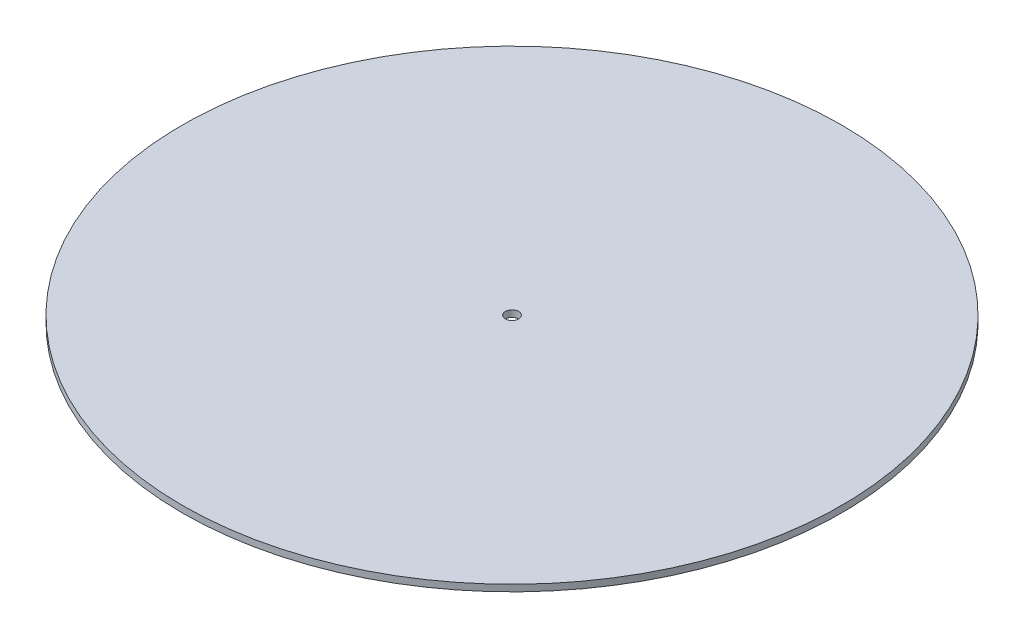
ISO-10303-21;
HEADER;
FILE_DESCRIPTION(('STEP AP214'),'2;1');
FILE_NAME('part.step','',(''),(''),'','','');
FILE_SCHEMA(('AUTOMOTIVE_DESIGN { 1 0 10303 214 1 1 1 1 }'));
ENDSEC;
DATA;
#1=APPLICATION_CONTEXT('core data for automotive mechanical design processes');
#2=APPLICATION_PROTOCOL_DEFINITION('international standard','automotive_design',2000,#1);
#3=PRODUCT_CONTEXT('',#1,'mechanical');
#4=PRODUCT('Part','Part','',(#3));
#5=PRODUCT_RELATED_PRODUCT_CATEGORY('part','',(#4));
#6=PRODUCT_DEFINITION_FORMATION('','',#4);
#7=PRODUCT_DEFINITION_CONTEXT('part definition',#1,'design');
#8=PRODUCT_DEFINITION('design','',#6,#7);
#9=PRODUCT_DEFINITION_SHAPE('','',#8);
#10=(LENGTH_UNIT() NAMED_UNIT(*) SI_UNIT(.MILLI.,.METRE.));
#11=(NAMED_UNIT(*) PLANE_ANGLE_UNIT() SI_UNIT($,.RADIAN.));
#12=(NAMED_UNIT(*) SI_UNIT($,.STERADIAN.) SOLID_ANGLE_UNIT());
#13=UNCERTAINTY_MEASURE_WITH_UNIT(LENGTH_MEASURE(1.E-05),#10,'distance_accuracy_value','');
#14=(GEOMETRIC_REPRESENTATION_CONTEXT(3) GLOBAL_UNCERTAINTY_ASSIGNED_CONTEXT((#13)) GLOBAL_UNIT_ASSIGNED_CONTEXT((#10,
#11,#12)) REPRESENTATION_CONTEXT('',''));
#15=CARTESIAN_POINT('',(0.,0.,0.));
#16=DIRECTION('',(0.,0.,1.));
#17=DIRECTION('',(1.,0.,0.));
#18=AXIS2_PLACEMENT_3D('',#15,#16,#17);
#19=CARTESIAN_POINT('',(0.,1.,0.));
#20=DIRECTION('',(0.,1.,0.));
#21=DIRECTION('',(0.,0.,1.));
#22=AXIS2_PLACEMENT_3D('',#19,#20,#21);
#23=PLANE('',#22);
#24=CARTESIAN_POINT('',(0.,1.,0.));
#25=DIRECTION('',(0.,1.,0.));
#26=DIRECTION('',(0.,0.,1.));
#27=AXIS2_PLACEMENT_3D('',#24,#25,#26);
#28=CIRCLE('',#27,50.);
#29=CARTESIAN_POINT('',(0.,1.,50.));
#30=VERTEX_POINT('',#29);
#31=EDGE_CURVE('E10',#30,#30,#28,.T.);
#32=ORIENTED_EDGE('',*,*,#31,.T.);
#33=EDGE_LOOP('',(#32));
#34=FACE_BOUND('',#33,.T.);
#35=CARTESIAN_POINT('',(0.,1.,0.));
#36=DIRECTION('',(0.,1.,0.));
#37=DIRECTION('',(0.,0.,1.));
#38=AXIS2_PLACEMENT_3D('',#35,#36,#37);
#39=CIRCLE('',#38,0.999999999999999);
#40=CARTESIAN_POINT('',(0.,1.,0.999999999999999));
#41=VERTEX_POINT('',#40);
#42=EDGE_CURVE('E41',#41,#41,#39,.T.);
#43=ORIENTED_EDGE('',*,*,#42,.F.);
#44=EDGE_LOOP('',(#43));
#45=FACE_BOUND('',#44,.T.);
#46=ADVANCED_FACE('F30',(#34,#45),#23,.T.);
#47=CARTESIAN_POINT('',(0.,0.,0.));
#48=DIRECTION('',(0.,1.,0.));
#49=DIRECTION('',(0.,0.,1.));
#50=AXIS2_PLACEMENT_3D('',#47,#48,#49);
#51=PLANE('',#50);
#52=CARTESIAN_POINT('',(0.,0.,0.));
#53=DIRECTION('',(0.,1.,0.));
#54=DIRECTION('',(0.,0.,1.));
#55=AXIS2_PLACEMENT_3D('',#52,#53,#54);
#56=CIRCLE('',#55,50.);
#57=CARTESIAN_POINT('',(0.,0.,50.));
#58=VERTEX_POINT('',#57);
#59=EDGE_CURVE('E37',#58,#58,#56,.T.);
#60=ORIENTED_EDGE('',*,*,#59,.F.);
#61=EDGE_LOOP('',(#60));
#62=FACE_BOUND('',#61,.T.);
#63=CARTESIAN_POINT('',(0.,0.,0.));
#64=DIRECTION('',(0.,1.,0.));
#65=DIRECTION('',(0.,0.,1.));
#66=AXIS2_PLACEMENT_3D('',#63,#64,#65);
#67=CIRCLE('',#66,0.999999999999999);
#68=CARTESIAN_POINT('',(0.,0.,0.999999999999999));
#69=VERTEX_POINT('',#68);
#70=EDGE_CURVE('E45',#69,#69,#67,.T.);
#71=ORIENTED_EDGE('',*,*,#70,.T.);
#72=EDGE_LOOP('',(#71));
#73=FACE_BOUND('',#72,.T.);
#74=ADVANCED_FACE('F51',(#62,#73),#51,.F.);
#75=CARTESIAN_POINT('',(0.,1.,0.));
#76=DIRECTION('',(0.,-1.,0.));
#77=DIRECTION('',(0.,0.,-1.));
#78=AXIS2_PLACEMENT_3D('',#75,#76,#77);
#79=CYLINDRICAL_SURFACE('',#78,50.);
#80=ORIENTED_EDGE('',*,*,#31,.F.);
#81=EDGE_LOOP('',(#80));
#82=FACE_BOUND('',#81,.T.);
#83=ORIENTED_EDGE('',*,*,#59,.T.);
#84=EDGE_LOOP('',(#83));
#85=FACE_BOUND('',#84,.T.);
#86=ADVANCED_FACE('F32',(#82,#85),#79,.T.);
#87=CARTESIAN_POINT('',(0.,1.,0.));
#88=DIRECTION('',(0.,-1.,0.));
#89=DIRECTION('',(0.,0.,-1.));
#90=AXIS2_PLACEMENT_3D('',#87,#88,#89);
#91=CYLINDRICAL_SURFACE('',#90,0.999999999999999);
#92=ORIENTED_EDGE('',*,*,#42,.T.);
#93=EDGE_LOOP('',(#92));
#94=FACE_BOUND('',#93,.T.);
#95=ORIENTED_EDGE('',*,*,#70,.F.);
#96=EDGE_LOOP('',(#95));
#97=FACE_BOUND('',#96,.T.);
#98=ADVANCED_FACE('F53',(#94,#97),#91,.F.);
#99=CLOSED_SHELL('',(#46,#74,#86,#98));
#100=MANIFOLD_SOLID_BREP('B2',#99);
#101=ADVANCED_BREP_SHAPE_REPRESENTATION('',(#18,#100),#14);
#102=SHAPE_DEFINITION_REPRESENTATION(#9,#101);
ENDSEC;
END-ISO-10303-21;
